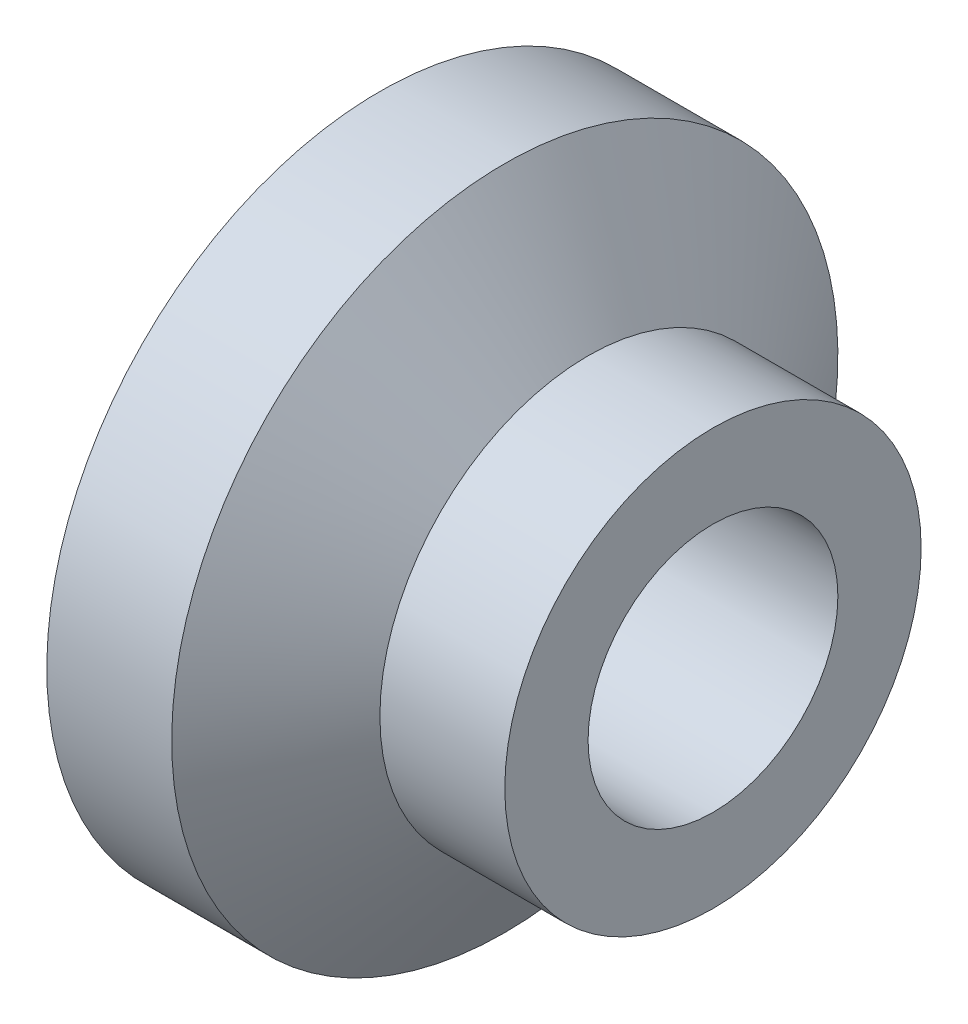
ISO-10303-21;
HEADER;
FILE_DESCRIPTION(('STEP AP214'),'2;1');
FILE_NAME('part.step','',(''),(''),'','','');
FILE_SCHEMA(('AUTOMOTIVE_DESIGN { 1 0 10303 214 1 1 1 1 }'));
ENDSEC;
DATA;
#1=APPLICATION_CONTEXT('core data for automotive mechanical design processes');
#2=APPLICATION_PROTOCOL_DEFINITION('international standard','automotive_design',2000,#1);
#3=PRODUCT_CONTEXT('',#1,'mechanical');
#4=PRODUCT('Part','Part','',(#3));
#5=PRODUCT_RELATED_PRODUCT_CATEGORY('part','',(#4));
#6=PRODUCT_DEFINITION_FORMATION('','',#4);
#7=PRODUCT_DEFINITION_CONTEXT('part definition',#1,'design');
#8=PRODUCT_DEFINITION('design','',#6,#7);
#9=PRODUCT_DEFINITION_SHAPE('','',#8);
#10=(LENGTH_UNIT() NAMED_UNIT(*) SI_UNIT(.MILLI.,.METRE.));
#11=(NAMED_UNIT(*) PLANE_ANGLE_UNIT() SI_UNIT($,.RADIAN.));
#12=(NAMED_UNIT(*) SI_UNIT($,.STERADIAN.) SOLID_ANGLE_UNIT());
#13=UNCERTAINTY_MEASURE_WITH_UNIT(LENGTH_MEASURE(1.E-05),#10,'distance_accuracy_value','');
#14=(GEOMETRIC_REPRESENTATION_CONTEXT(3) GLOBAL_UNCERTAINTY_ASSIGNED_CONTEXT((#13)) GLOBAL_UNIT_ASSIGNED_CONTEXT((#10,
#11,#12)) REPRESENTATION_CONTEXT('',''));
#15=CARTESIAN_POINT('',(0.,0.,0.));
#16=DIRECTION('',(0.,0.,1.));
#17=DIRECTION('',(1.,0.,0.));
#18=AXIS2_PLACEMENT_3D('',#15,#16,#17);
#19=CARTESIAN_POINT('',(4.,0.,0.));
#20=DIRECTION('',(-1.,0.,0.));
#21=DIRECTION('',(0.,-1.,0.));
#22=AXIS2_PLACEMENT_3D('',#19,#20,#21);
#23=PLANE('',#22);
#24=CARTESIAN_POINT('',(4.,0.,0.));
#25=DIRECTION('',(-1.,0.,0.));
#26=DIRECTION('',(0.,-1.,0.));
#27=AXIS2_PLACEMENT_3D('',#24,#25,#26);
#28=CIRCLE('',#27,1.5);
#29=CARTESIAN_POINT('',(4.,-1.5,0.));
#30=VERTEX_POINT('',#29);
#31=EDGE_CURVE('E43',#30,#30,#28,.T.);
#32=ORIENTED_EDGE('',*,*,#31,.T.);
#33=EDGE_LOOP('',(#32));
#34=FACE_BOUND('',#33,.T.);
#35=CARTESIAN_POINT('',(4.,0.,0.));
#36=DIRECTION('',(-1.,0.,0.));
#37=DIRECTION('',(0.,-1.,0.));
#38=AXIS2_PLACEMENT_3D('',#35,#36,#37);
#39=CIRCLE('',#38,2.49999999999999);
#40=CARTESIAN_POINT('',(4.,-2.49999999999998,0.));
#41=VERTEX_POINT('',#40);
#42=EDGE_CURVE('E10',#41,#41,#39,.T.);
#43=ORIENTED_EDGE('',*,*,#42,.F.);
#44=EDGE_LOOP('',(#43));
#45=FACE_BOUND('',#44,.T.);
#46=ADVANCED_FACE('F24',(#34,#45),#23,.F.);
#47=CARTESIAN_POINT('',(-58.0042175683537,0.,0.));
#48=DIRECTION('',(-1.,0.,0.));
#49=DIRECTION('',(0.,-1.,0.));
#50=AXIS2_PLACEMENT_3D('',#47,#48,#49);
#51=CYLINDRICAL_SURFACE('',#50,2.49999999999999);
#52=CARTESIAN_POINT('',(2.5,0.,0.));
#53=DIRECTION('',(-1.,0.,0.));
#54=DIRECTION('',(0.,-1.,0.));
#55=AXIS2_PLACEMENT_3D('',#52,#53,#54);
#56=CIRCLE('',#55,2.49999999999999);
#57=CARTESIAN_POINT('',(2.5,-2.49999999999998,0.));
#58=VERTEX_POINT('',#57);
#59=EDGE_CURVE('E30',#58,#58,#56,.T.);
#60=ORIENTED_EDGE('',*,*,#59,.F.);
#61=EDGE_LOOP('',(#60));
#62=FACE_BOUND('',#61,.T.);
#63=ORIENTED_EDGE('',*,*,#42,.T.);
#64=EDGE_LOOP('',(#63));
#65=FACE_BOUND('',#64,.T.);
#66=ADVANCED_FACE('F66',(#62,#65),#51,.T.);
#67=CARTESIAN_POINT('',(2.5,0.,0.));
#68=DIRECTION('',(-1.,0.,0.));
#69=DIRECTION('',(0.,-1.,0.));
#70=AXIS2_PLACEMENT_3D('',#67,#68,#69);
#71=CONICAL_SURFACE('',#70,2.49999999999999,0.982793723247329);
#72=CARTESIAN_POINT('',(1.5,0.,0.));
#73=DIRECTION('',(-1.,0.,0.));
#74=DIRECTION('',(0.,-1.,0.));
#75=AXIS2_PLACEMENT_3D('',#72,#73,#74);
#76=CIRCLE('',#75,3.99999999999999);
#77=CARTESIAN_POINT('',(1.5,-3.99999999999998,0.));
#78=VERTEX_POINT('',#77);
#79=EDGE_CURVE('E34',#78,#78,#76,.T.);
#80=ORIENTED_EDGE('',*,*,#79,.F.);
#81=EDGE_LOOP('',(#80));
#82=FACE_BOUND('',#81,.T.);
#83=ORIENTED_EDGE('',*,*,#59,.T.);
#84=EDGE_LOOP('',(#83));
#85=FACE_BOUND('',#84,.T.);
#86=ADVANCED_FACE('F61',(#82,#85),#71,.T.);
#87=CARTESIAN_POINT('',(-58.0042175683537,0.,0.));
#88=DIRECTION('',(-1.,0.,0.));
#89=DIRECTION('',(0.,-1.,0.));
#90=AXIS2_PLACEMENT_3D('',#87,#88,#89);
#91=CYLINDRICAL_SURFACE('',#90,3.99999999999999);
#92=CARTESIAN_POINT('',(0.,0.,0.));
#93=DIRECTION('',(-1.,0.,0.));
#94=DIRECTION('',(0.,-1.,0.));
#95=AXIS2_PLACEMENT_3D('',#92,#93,#94);
#96=CIRCLE('',#95,3.99999999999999);
#97=CARTESIAN_POINT('',(0.,-3.99999999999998,0.));
#98=VERTEX_POINT('',#97);
#99=EDGE_CURVE('E38',#98,#98,#96,.T.);
#100=ORIENTED_EDGE('',*,*,#99,.F.);
#101=EDGE_LOOP('',(#100));
#102=FACE_BOUND('',#101,.T.);
#103=ORIENTED_EDGE('',*,*,#79,.T.);
#104=EDGE_LOOP('',(#103));
#105=FACE_BOUND('',#104,.T.);
#106=ADVANCED_FACE('F55',(#102,#105),#91,.T.);
#107=CARTESIAN_POINT('',(0.,0.,0.));
#108=DIRECTION('',(1.,0.,0.));
#109=DIRECTION('',(0.,1.,0.));
#110=AXIS2_PLACEMENT_3D('',#107,#108,#109);
#111=PLANE('',#110);
#112=CARTESIAN_POINT('',(0.,0.,0.));
#113=DIRECTION('',(-1.,0.,0.));
#114=DIRECTION('',(0.,-1.,0.));
#115=AXIS2_PLACEMENT_3D('',#112,#113,#114);
#116=CIRCLE('',#115,1.5);
#117=CARTESIAN_POINT('',(0.,-1.5,0.));
#118=VERTEX_POINT('',#117);
#119=EDGE_CURVE('E46',#118,#118,#116,.T.);
#120=ORIENTED_EDGE('',*,*,#119,.F.);
#121=EDGE_LOOP('',(#120));
#122=FACE_BOUND('',#121,.T.);
#123=ORIENTED_EDGE('',*,*,#99,.T.);
#124=EDGE_LOOP('',(#123));
#125=FACE_BOUND('',#124,.T.);
#126=ADVANCED_FACE('F52',(#122,#125),#111,.F.);
#127=CARTESIAN_POINT('',(4.,0.,0.));
#128=DIRECTION('',(-1.,0.,0.));
#129=DIRECTION('',(0.,-1.,0.));
#130=AXIS2_PLACEMENT_3D('',#127,#128,#129);
#131=CYLINDRICAL_SURFACE('',#130,1.5);
#132=ORIENTED_EDGE('',*,*,#31,.F.);
#133=EDGE_LOOP('',(#132));
#134=FACE_BOUND('',#133,.T.);
#135=ORIENTED_EDGE('',*,*,#119,.T.);
#136=EDGE_LOOP('',(#135));
#137=FACE_BOUND('',#136,.T.);
#138=ADVANCED_FACE('F50',(#134,#137),#131,.F.);
#139=CLOSED_SHELL('',(#46,#66,#86,#106,#126,#138));
#140=MANIFOLD_SOLID_BREP('B2',#139);
#141=ADVANCED_BREP_SHAPE_REPRESENTATION('',(#18,#140),#14);
#142=SHAPE_DEFINITION_REPRESENTATION(#9,#141);
ENDSEC;
END-ISO-10303-21;
